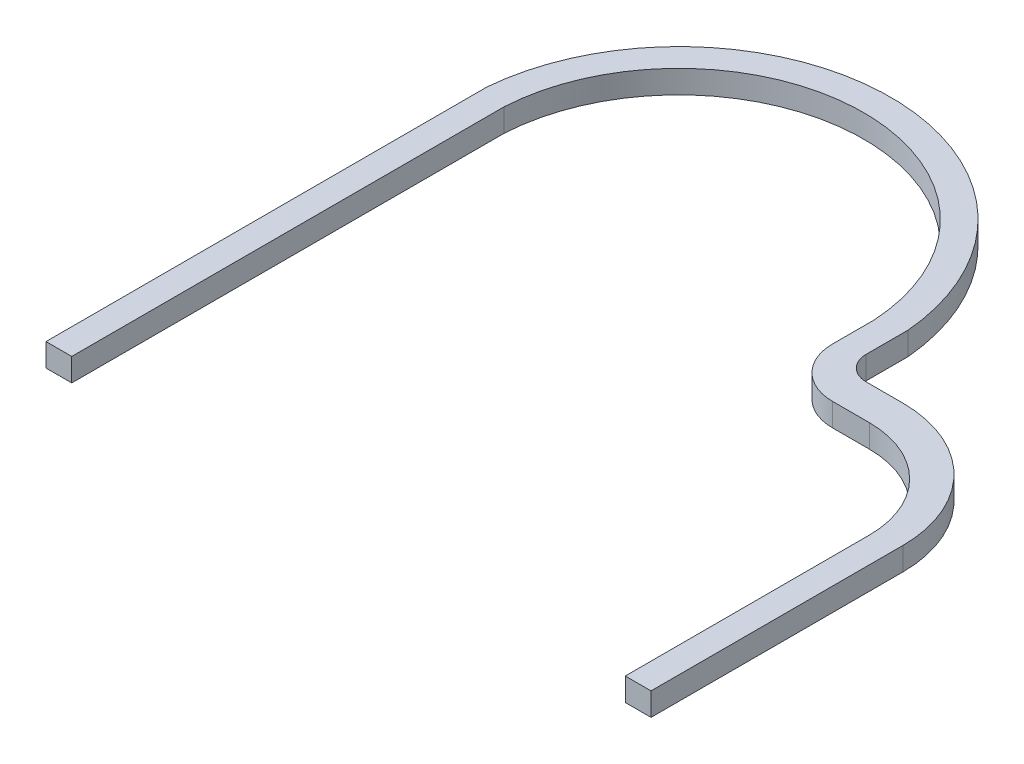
ISO-10303-21;
HEADER;
FILE_DESCRIPTION(('STEP AP214'),'2;1');
FILE_NAME('part.step','',(''),(''),'','','');
FILE_SCHEMA(('AUTOMOTIVE_DESIGN { 1 0 10303 214 1 1 1 1 }'));
ENDSEC;
DATA;
#1=APPLICATION_CONTEXT('core data for automotive mechanical design processes');
#2=APPLICATION_PROTOCOL_DEFINITION('international standard','automotive_design',2000,#1);
#3=PRODUCT_CONTEXT('',#1,'mechanical');
#4=PRODUCT('Part','Part','',(#3));
#5=PRODUCT_RELATED_PRODUCT_CATEGORY('part','',(#4));
#6=PRODUCT_DEFINITION_FORMATION('','',#4);
#7=PRODUCT_DEFINITION_CONTEXT('part definition',#1,'design');
#8=PRODUCT_DEFINITION('design','',#6,#7);
#9=PRODUCT_DEFINITION_SHAPE('','',#8);
#10=(LENGTH_UNIT() NAMED_UNIT(*) SI_UNIT(.MILLI.,.METRE.));
#11=(NAMED_UNIT(*) PLANE_ANGLE_UNIT() SI_UNIT($,.RADIAN.));
#12=(NAMED_UNIT(*) SI_UNIT($,.STERADIAN.) SOLID_ANGLE_UNIT());
#13=UNCERTAINTY_MEASURE_WITH_UNIT(LENGTH_MEASURE(1.E-05),#10,'distance_accuracy_value','');
#14=(GEOMETRIC_REPRESENTATION_CONTEXT(3) GLOBAL_UNCERTAINTY_ASSIGNED_CONTEXT((#13)) GLOBAL_UNIT_ASSIGNED_CONTEXT((#10,
#11,#12)) REPRESENTATION_CONTEXT('',''));
#15=CARTESIAN_POINT('',(0.,0.,0.));
#16=DIRECTION('',(0.,0.,1.));
#17=DIRECTION('',(1.,0.,0.));
#18=AXIS2_PLACEMENT_3D('',#15,#16,#17);
#19=CARTESIAN_POINT('',(-10.16,3.175,11.2564952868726));
#20=DIRECTION('',(0.,-1.,0.));
#21=DIRECTION('',(0.,0.,-1.));
#22=AXIS2_PLACEMENT_3D('',#19,#20,#21);
#23=CYLINDRICAL_SURFACE('',#22,13.462);
#24=CARTESIAN_POINT('',(-10.16,0.,11.2564952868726));
#25=DIRECTION('',(0.,1.,0.));
#26=DIRECTION('',(0.,0.,1.));
#27=AXIS2_PLACEMENT_3D('',#24,#25,#26);
#28=CIRCLE('',#27,13.462);
#29=CARTESIAN_POINT('',(3.30200000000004,0.,11.2564952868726));
#30=VERTEX_POINT('',#29);
#31=CARTESIAN_POINT('',(-10.16,0.,-2.20550471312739));
#32=VERTEX_POINT('',#31);
#33=EDGE_CURVE('E176',#30,#32,#28,.T.);
#34=ORIENTED_EDGE('',*,*,#33,.F.);
#35=DIRECTION('',(0.,-1.,0.));
#36=VECTOR('',#35,1.);
#37=CARTESIAN_POINT('',(3.30200000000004,3.175,11.2564952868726));
#38=LINE('',#37,#36);
#39=CARTESIAN_POINT('',(3.30200000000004,3.175,11.2564952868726));
#40=VERTEX_POINT('',#39);
#41=EDGE_CURVE('E11',#40,#30,#38,.T.);
#42=ORIENTED_EDGE('',*,*,#41,.F.);
#43=CARTESIAN_POINT('',(-10.16,3.175,11.2564952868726));
#44=DIRECTION('',(0.,1.,0.));
#45=DIRECTION('',(0.,0.,1.));
#46=AXIS2_PLACEMENT_3D('',#43,#44,#45);
#47=CIRCLE('',#46,13.462);
#48=CARTESIAN_POINT('',(-10.16,3.175,-2.20550471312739));
#49=VERTEX_POINT('',#48);
#50=EDGE_CURVE('E216',#40,#49,#47,.T.);
#51=ORIENTED_EDGE('',*,*,#50,.T.);
#52=DIRECTION('',(0.,-1.,0.));
#53=VECTOR('',#52,1.);
#54=CARTESIAN_POINT('',(-10.16,3.175,-2.20550471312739));
#55=LINE('',#54,#53);
#56=EDGE_CURVE('E51',#49,#32,#55,.T.);
#57=ORIENTED_EDGE('',*,*,#56,.T.);
#58=EDGE_LOOP('',(#34,#42,#51,#57));
#59=FACE_BOUND('',#58,.T.);
#60=ADVANCED_FACE('F35',(#59),#23,.F.);
#61=CARTESIAN_POINT('',(3.30200000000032,3.175,0.));
#62=DIRECTION('',(1.,0.,0.));
#63=DIRECTION('',(0.,0.,-1.));
#64=AXIS2_PLACEMENT_3D('',#61,#62,#63);
#65=PLANE('',#64);
#66=DIRECTION('',(0.,0.,1.));
#67=VECTOR('',#66,1.);
#68=CARTESIAN_POINT('',(3.30200000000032,0.,0.));
#69=LINE('',#68,#67);
#70=CARTESIAN_POINT('',(3.30199999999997,0.,44.958));
#71=VERTEX_POINT('',#70);
#72=EDGE_CURVE('E178',#30,#71,#69,.T.);
#73=ORIENTED_EDGE('',*,*,#72,.T.);
#74=DIRECTION('',(0.,-1.,0.));
#75=VECTOR('',#74,1.);
#76=CARTESIAN_POINT('',(3.30199999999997,3.175,44.958));
#77=LINE('',#76,#75);
#78=CARTESIAN_POINT('',(3.30199999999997,3.175,44.958));
#79=VERTEX_POINT('',#78);
#80=EDGE_CURVE('E43',#79,#71,#77,.T.);
#81=ORIENTED_EDGE('',*,*,#80,.F.);
#82=DIRECTION('',(0.,0.,1.));
#83=VECTOR('',#82,1.);
#84=CARTESIAN_POINT('',(3.30200000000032,3.175,0.));
#85=LINE('',#84,#83);
#86=EDGE_CURVE('E532',#40,#79,#85,.T.);
#87=ORIENTED_EDGE('',*,*,#86,.F.);
#88=ORIENTED_EDGE('',*,*,#41,.T.);
#89=EDGE_LOOP('',(#73,#81,#87,#88));
#90=FACE_BOUND('',#89,.T.);
#91=ADVANCED_FACE('F252',(#90),#65,.F.);
#92=CARTESIAN_POINT('',(0.,3.175,44.958));
#93=DIRECTION('',(0.,0.,1.));
#94=DIRECTION('',(1.,0.,0.));
#95=AXIS2_PLACEMENT_3D('',#92,#93,#94);
#96=PLANE('',#95);
#97=DIRECTION('',(-1.,0.,0.));
#98=VECTOR('',#97,1.);
#99=CARTESIAN_POINT('',(0.,0.,44.958));
#100=LINE('',#99,#98);
#101=CARTESIAN_POINT('',(6.858,0.,44.958));
#102=VERTEX_POINT('',#101);
#103=EDGE_CURVE('E181',#102,#71,#100,.T.);
#104=ORIENTED_EDGE('',*,*,#103,.F.);
#105=DIRECTION('',(0.,-1.,0.));
#106=VECTOR('',#105,1.);
#107=CARTESIAN_POINT('',(6.858,3.175,44.958));
#108=LINE('',#107,#106);
#109=CARTESIAN_POINT('',(6.858,3.175,44.958));
#110=VERTEX_POINT('',#109);
#111=EDGE_CURVE('E242',#110,#102,#108,.T.);
#112=ORIENTED_EDGE('',*,*,#111,.F.);
#113=DIRECTION('',(-1.,0.,0.));
#114=VECTOR('',#113,1.);
#115=CARTESIAN_POINT('',(0.,3.175,44.958));
#116=LINE('',#115,#114);
#117=EDGE_CURVE('E249',#110,#79,#116,.T.);
#118=ORIENTED_EDGE('',*,*,#117,.T.);
#119=ORIENTED_EDGE('',*,*,#80,.T.);
#120=EDGE_LOOP('',(#104,#112,#118,#119));
#121=FACE_BOUND('',#120,.T.);
#122=ADVANCED_FACE('F247',(#121),#96,.T.);
#123=CARTESIAN_POINT('',(6.858,3.175,0.));
#124=DIRECTION('',(-1.,0.,0.));
#125=DIRECTION('',(0.,0.,1.));
#126=AXIS2_PLACEMENT_3D('',#123,#124,#125);
#127=PLANE('',#126);
#128=DIRECTION('',(0.,0.,-1.));
#129=VECTOR('',#128,1.);
#130=CARTESIAN_POINT('',(6.858,0.,0.));
#131=LINE('',#130,#129);
#132=CARTESIAN_POINT('',(6.858,0.,10.16));
#133=VERTEX_POINT('',#132);
#134=EDGE_CURVE('E184',#102,#133,#131,.T.);
#135=ORIENTED_EDGE('',*,*,#134,.T.);
#136=DIRECTION('',(0.,-1.,0.));
#137=VECTOR('',#136,1.);
#138=CARTESIAN_POINT('',(6.858,3.175,10.16));
#139=LINE('',#138,#137);
#140=CARTESIAN_POINT('',(6.858,3.175,10.16));
#141=VERTEX_POINT('',#140);
#142=EDGE_CURVE('E239',#141,#133,#139,.T.);
#143=ORIENTED_EDGE('',*,*,#142,.F.);
#144=DIRECTION('',(0.,0.,-1.));
#145=VECTOR('',#144,1.);
#146=CARTESIAN_POINT('',(6.858,3.175,0.));
#147=LINE('',#146,#145);
#148=EDGE_CURVE('E269',#110,#141,#147,.T.);
#149=ORIENTED_EDGE('',*,*,#148,.F.);
#150=ORIENTED_EDGE('',*,*,#111,.T.);
#151=EDGE_LOOP('',(#135,#143,#149,#150));
#152=FACE_BOUND('',#151,.T.);
#153=ADVANCED_FACE('F260',(#152),#127,.F.);
#154=CARTESIAN_POINT('',(-10.16,3.175,10.16));
#155=DIRECTION('',(0.,-1.,0.));
#156=DIRECTION('',(0.,0.,-1.));
#157=AXIS2_PLACEMENT_3D('',#154,#155,#156);
#158=CYLINDRICAL_SURFACE('',#157,17.018);
#159=CARTESIAN_POINT('',(-10.16,0.,10.16));
#160=DIRECTION('',(0.,1.,0.));
#161=DIRECTION('',(0.,0.,1.));
#162=AXIS2_PLACEMENT_3D('',#159,#160,#161);
#163=CIRCLE('',#162,17.018);
#164=CARTESIAN_POINT('',(-10.16,0.,-6.858));
#165=VERTEX_POINT('',#164);
#166=EDGE_CURVE('E186',#133,#165,#163,.T.);
#167=ORIENTED_EDGE('',*,*,#166,.T.);
#168=DIRECTION('',(0.,-1.,0.));
#169=VECTOR('',#168,1.);
#170=CARTESIAN_POINT('',(-10.16,3.175,-6.858));
#171=LINE('',#170,#169);
#172=CARTESIAN_POINT('',(-10.16,3.175,-6.858));
#173=VERTEX_POINT('',#172);
#174=EDGE_CURVE('E236',#173,#165,#171,.T.);
#175=ORIENTED_EDGE('',*,*,#174,.F.);
#176=CARTESIAN_POINT('',(-10.16,3.175,10.16));
#177=DIRECTION('',(0.,1.,0.));
#178=DIRECTION('',(0.,0.,1.));
#179=AXIS2_PLACEMENT_3D('',#176,#177,#178);
#180=CIRCLE('',#179,17.018);
#181=EDGE_CURVE('E266',#141,#173,#180,.T.);
#182=ORIENTED_EDGE('',*,*,#181,.F.);
#183=ORIENTED_EDGE('',*,*,#142,.T.);
#184=EDGE_LOOP('',(#167,#175,#182,#183));
#185=FACE_BOUND('',#184,.T.);
#186=ADVANCED_FACE('F264',(#185),#158,.T.);
#187=CARTESIAN_POINT('',(0.,3.175,-6.858));
#188=DIRECTION('',(0.,0.,1.));
#189=DIRECTION('',(1.,0.,0.));
#190=AXIS2_PLACEMENT_3D('',#187,#188,#189);
#191=PLANE('',#190);
#192=DIRECTION('',(-1.,0.,0.));
#193=VECTOR('',#192,1.);
#194=CARTESIAN_POINT('',(0.,0.,-6.858));
#195=LINE('',#194,#193);
#196=CARTESIAN_POINT('',(-15.24,0.,-6.858));
#197=VERTEX_POINT('',#196);
#198=EDGE_CURVE('E188',#165,#197,#195,.T.);
#199=ORIENTED_EDGE('',*,*,#198,.T.);
#200=DIRECTION('',(0.,-1.,0.));
#201=VECTOR('',#200,1.);
#202=CARTESIAN_POINT('',(-15.24,3.175,-6.858));
#203=LINE('',#202,#201);
#204=CARTESIAN_POINT('',(-15.24,3.175,-6.858));
#205=VERTEX_POINT('',#204);
#206=EDGE_CURVE('E233',#205,#197,#203,.T.);
#207=ORIENTED_EDGE('',*,*,#206,.F.);
#208=DIRECTION('',(-1.,0.,0.));
#209=VECTOR('',#208,1.);
#210=CARTESIAN_POINT('',(0.,3.175,-6.858));
#211=LINE('',#210,#209);
#212=EDGE_CURVE('E268',#173,#205,#211,.T.);
#213=ORIENTED_EDGE('',*,*,#212,.F.);
#214=ORIENTED_EDGE('',*,*,#174,.T.);
#215=EDGE_LOOP('',(#199,#207,#213,#214));
#216=FACE_BOUND('',#215,.T.);
#217=ADVANCED_FACE('F316',(#216),#191,.F.);
#218=CARTESIAN_POINT('',(-15.24,3.175,-10.16));
#219=DIRECTION('',(0.,-1.,0.));
#220=DIRECTION('',(0.,0.,-1.));
#221=AXIS2_PLACEMENT_3D('',#218,#219,#220);
#222=CYLINDRICAL_SURFACE('',#221,3.302);
#223=CARTESIAN_POINT('',(-15.24,0.,-10.16));
#224=DIRECTION('',(0.,1.,0.));
#225=DIRECTION('',(0.,0.,1.));
#226=AXIS2_PLACEMENT_3D('',#223,#224,#225);
#227=CIRCLE('',#226,3.302);
#228=CARTESIAN_POINT('',(-18.542,0.,-10.16));
#229=VERTEX_POINT('',#228);
#230=EDGE_CURVE('E190',#197,#229,#227,.F.);
#231=ORIENTED_EDGE('',*,*,#230,.T.);
#232=DIRECTION('',(0.,-1.,0.));
#233=VECTOR('',#232,1.);
#234=CARTESIAN_POINT('',(-18.542,3.175,-10.16));
#235=LINE('',#234,#233);
#236=CARTESIAN_POINT('',(-18.542,3.175,-10.16));
#237=VERTEX_POINT('',#236);
#238=EDGE_CURVE('E231',#237,#229,#235,.T.);
#239=ORIENTED_EDGE('',*,*,#238,.F.);
#240=CARTESIAN_POINT('',(-15.24,3.175,-10.16));
#241=DIRECTION('',(0.,1.,0.));
#242=DIRECTION('',(0.,0.,1.));
#243=AXIS2_PLACEMENT_3D('',#240,#241,#242);
#244=CIRCLE('',#243,3.302);
#245=EDGE_CURVE('E271',#205,#237,#244,.F.);
#246=ORIENTED_EDGE('',*,*,#245,.F.);
#247=ORIENTED_EDGE('',*,*,#206,.T.);
#248=EDGE_LOOP('',(#231,#239,#246,#247));
#249=FACE_BOUND('',#248,.T.);
#250=ADVANCED_FACE('F319',(#249),#222,.F.);
#251=CARTESIAN_POINT('',(-18.5420000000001,3.175,-2.66482218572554E-13));
#252=DIRECTION('',(1.,0.,0.));
#253=DIRECTION('',(0.,0.,-1.));
#254=AXIS2_PLACEMENT_3D('',#251,#252,#253);
#255=PLANE('',#254);
#256=DIRECTION('',(0.,0.,1.));
#257=VECTOR('',#256,1.);
#258=CARTESIAN_POINT('',(-18.5420000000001,0.,-2.66482218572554E-13));
#259=LINE('',#258,#257);
#260=CARTESIAN_POINT('',(-18.5419999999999,0.,-15.9537511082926));
#261=VERTEX_POINT('',#260);
#262=EDGE_CURVE('E193',#261,#229,#259,.T.);
#263=ORIENTED_EDGE('',*,*,#262,.F.);
#264=DIRECTION('',(0.,-1.,0.));
#265=VECTOR('',#264,1.);
#266=CARTESIAN_POINT('',(-18.5419999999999,3.175,-15.9537511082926));
#267=LINE('',#266,#265);
#268=CARTESIAN_POINT('',(-18.5419999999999,3.175,-15.9537511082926));
#269=VERTEX_POINT('',#268);
#270=EDGE_CURVE('E229',#269,#261,#267,.T.);
#271=ORIENTED_EDGE('',*,*,#270,.F.);
#272=DIRECTION('',(0.,0.,1.));
#273=VECTOR('',#272,1.);
#274=CARTESIAN_POINT('',(-18.5420000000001,3.175,-2.66482218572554E-13));
#275=LINE('',#274,#273);
#276=EDGE_CURVE('E277',#269,#237,#275,.T.);
#277=ORIENTED_EDGE('',*,*,#276,.T.);
#278=ORIENTED_EDGE('',*,*,#238,.T.);
#279=EDGE_LOOP('',(#263,#271,#277,#278));
#280=FACE_BOUND('',#279,.T.);
#281=ADVANCED_FACE('F323',(#280),#255,.T.);
#282=CARTESIAN_POINT('',(-47.625,3.175,-13.4125578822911));
#283=DIRECTION('',(0.,-1.,0.));
#284=DIRECTION('',(0.,0.,-1.));
#285=AXIS2_PLACEMENT_3D('',#282,#283,#284);
#286=CYLINDRICAL_SURFACE('',#285,29.1938101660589);
#287=CARTESIAN_POINT('',(-47.625,0.,-13.4125578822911));
#288=DIRECTION('',(0.,1.,0.));
#289=DIRECTION('',(0.,0.,1.));
#290=AXIS2_PLACEMENT_3D('',#287,#288,#289);
#291=CIRCLE('',#290,29.1938101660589);
#292=CARTESIAN_POINT('',(-76.708,0.,-15.9537511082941));
#293=VERTEX_POINT('',#292);
#294=EDGE_CURVE('E196',#261,#293,#291,.T.);
#295=ORIENTED_EDGE('',*,*,#294,.T.);
#296=DIRECTION('',(0.,-1.,0.));
#297=VECTOR('',#296,1.);
#298=CARTESIAN_POINT('',(-76.708,3.175,-15.9537511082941));
#299=LINE('',#298,#297);
#300=CARTESIAN_POINT('',(-76.708,3.175,-15.9537511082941));
#301=VERTEX_POINT('',#300);
#302=EDGE_CURVE('E227',#301,#293,#299,.T.);
#303=ORIENTED_EDGE('',*,*,#302,.F.);
#304=CARTESIAN_POINT('',(-47.625,3.175,-13.4125578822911));
#305=DIRECTION('',(0.,1.,0.));
#306=DIRECTION('',(0.,0.,1.));
#307=AXIS2_PLACEMENT_3D('',#304,#305,#306);
#308=CIRCLE('',#307,29.1938101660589);
#309=EDGE_CURVE('E280',#269,#301,#308,.T.);
#310=ORIENTED_EDGE('',*,*,#309,.F.);
#311=ORIENTED_EDGE('',*,*,#270,.T.);
#312=EDGE_LOOP('',(#295,#303,#310,#311));
#313=FACE_BOUND('',#312,.T.);
#314=ADVANCED_FACE('F327',(#313),#286,.T.);
#315=CARTESIAN_POINT('',(-76.708,3.175,0.));
#316=DIRECTION('',(-1.,0.,0.));
#317=DIRECTION('',(0.,0.,1.));
#318=AXIS2_PLACEMENT_3D('',#315,#316,#317);
#319=PLANE('',#318);
#320=DIRECTION('',(0.,0.,-1.));
#321=VECTOR('',#320,1.);
#322=CARTESIAN_POINT('',(-76.708,0.,0.));
#323=LINE('',#322,#321);
#324=CARTESIAN_POINT('',(-76.708,0.,44.958));
#325=VERTEX_POINT('',#324);
#326=EDGE_CURVE('E199',#325,#293,#323,.T.);
#327=ORIENTED_EDGE('',*,*,#326,.F.);
#328=DIRECTION('',(0.,-1.,0.));
#329=VECTOR('',#328,1.);
#330=CARTESIAN_POINT('',(-76.708,3.175,44.958));
#331=LINE('',#330,#329);
#332=CARTESIAN_POINT('',(-76.708,3.175,44.958));
#333=VERTEX_POINT('',#332);
#334=EDGE_CURVE('E225',#333,#325,#331,.T.);
#335=ORIENTED_EDGE('',*,*,#334,.F.);
#336=DIRECTION('',(0.,0.,-1.));
#337=VECTOR('',#336,1.);
#338=CARTESIAN_POINT('',(-76.708,3.175,0.));
#339=LINE('',#338,#337);
#340=EDGE_CURVE('E282',#333,#301,#339,.T.);
#341=ORIENTED_EDGE('',*,*,#340,.T.);
#342=ORIENTED_EDGE('',*,*,#302,.T.);
#343=EDGE_LOOP('',(#327,#335,#341,#342));
#344=FACE_BOUND('',#343,.T.);
#345=ADVANCED_FACE('F331',(#344),#319,.T.);
#346=CARTESIAN_POINT('',(0.,3.175,44.958));
#347=DIRECTION('',(0.,0.,-1.));
#348=DIRECTION('',(-1.,0.,0.));
#349=AXIS2_PLACEMENT_3D('',#346,#347,#348);
#350=PLANE('',#349);
#351=DIRECTION('',(1.,0.,0.));
#352=VECTOR('',#351,1.);
#353=CARTESIAN_POINT('',(0.,0.,44.958));
#354=LINE('',#353,#352);
#355=CARTESIAN_POINT('',(-73.152,0.,44.958));
#356=VERTEX_POINT('',#355);
#357=EDGE_CURVE('E202',#325,#356,#354,.T.);
#358=ORIENTED_EDGE('',*,*,#357,.T.);
#359=DIRECTION('',(0.,-1.,0.));
#360=VECTOR('',#359,1.);
#361=CARTESIAN_POINT('',(-73.152,3.175,44.958));
#362=LINE('',#361,#360);
#363=CARTESIAN_POINT('',(-73.152,3.175,44.958));
#364=VERTEX_POINT('',#363);
#365=EDGE_CURVE('E222',#364,#356,#362,.T.);
#366=ORIENTED_EDGE('',*,*,#365,.F.);
#367=DIRECTION('',(1.,0.,0.));
#368=VECTOR('',#367,1.);
#369=CARTESIAN_POINT('',(0.,3.175,44.958));
#370=LINE('',#369,#368);
#371=EDGE_CURVE('E285',#333,#364,#370,.T.);
#372=ORIENTED_EDGE('',*,*,#371,.F.);
#373=ORIENTED_EDGE('',*,*,#334,.T.);
#374=EDGE_LOOP('',(#358,#366,#372,#373));
#375=FACE_BOUND('',#374,.T.);
#376=ADVANCED_FACE('F335',(#375),#350,.F.);
#377=CARTESIAN_POINT('',(-73.152,3.175,0.));
#378=DIRECTION('',(-1.,0.,0.));
#379=DIRECTION('',(0.,0.,1.));
#380=AXIS2_PLACEMENT_3D('',#377,#378,#379);
#381=PLANE('',#380);
#382=DIRECTION('',(0.,0.,-1.));
#383=VECTOR('',#382,1.);
#384=CARTESIAN_POINT('',(-73.152,0.,0.));
#385=LINE('',#384,#383);
#386=CARTESIAN_POINT('',(-73.152,0.,-14.7785047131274));
#387=VERTEX_POINT('',#386);
#388=EDGE_CURVE('E204',#356,#387,#385,.T.);
#389=ORIENTED_EDGE('',*,*,#388,.T.);
#390=DIRECTION('',(0.,-1.,0.));
#391=VECTOR('',#390,1.);
#392=CARTESIAN_POINT('',(-73.152,3.175,-14.7785047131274));
#393=LINE('',#392,#391);
#394=CARTESIAN_POINT('',(-73.152,3.175,-14.7785047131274));
#395=VERTEX_POINT('',#394);
#396=EDGE_CURVE('E220',#395,#387,#393,.T.);
#397=ORIENTED_EDGE('',*,*,#396,.F.);
#398=DIRECTION('',(0.,0.,-1.));
#399=VECTOR('',#398,1.);
#400=CARTESIAN_POINT('',(-73.152,3.175,0.));
#401=LINE('',#400,#399);
#402=EDGE_CURVE('E287',#364,#395,#401,.T.);
#403=ORIENTED_EDGE('',*,*,#402,.F.);
#404=ORIENTED_EDGE('',*,*,#365,.T.);
#405=EDGE_LOOP('',(#389,#397,#403,#404));
#406=FACE_BOUND('',#405,.T.);
#407=ADVANCED_FACE('F339',(#406),#381,.F.);
#408=CARTESIAN_POINT('',(-47.625,3.175,-13.335));
#409=DIRECTION('',(0.,-1.,0.));
#410=DIRECTION('',(0.,0.,-1.));
#411=AXIS2_PLACEMENT_3D('',#408,#409,#410);
#412=CYLINDRICAL_SURFACE('',#411,25.5677811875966);
#413=CARTESIAN_POINT('',(-47.625,0.,-13.335));
#414=DIRECTION('',(0.,1.,0.));
#415=DIRECTION('',(0.,0.,1.));
#416=AXIS2_PLACEMENT_3D('',#413,#414,#415);
#417=CIRCLE('',#416,25.5677811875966);
#418=CARTESIAN_POINT('',(-22.098,0.,-14.7785047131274));
#419=VERTEX_POINT('',#418);
#420=EDGE_CURVE('E207',#419,#387,#417,.T.);
#421=ORIENTED_EDGE('',*,*,#420,.F.);
#422=DIRECTION('',(0.,-1.,0.));
#423=VECTOR('',#422,1.);
#424=CARTESIAN_POINT('',(-22.098,3.175,-14.7785047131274));
#425=LINE('',#424,#423);
#426=CARTESIAN_POINT('',(-22.098,3.175,-14.7785047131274));
#427=VERTEX_POINT('',#426);
#428=EDGE_CURVE('E168',#427,#419,#425,.T.);
#429=ORIENTED_EDGE('',*,*,#428,.F.);
#430=CARTESIAN_POINT('',(-47.625,3.175,-13.335));
#431=DIRECTION('',(0.,1.,0.));
#432=DIRECTION('',(0.,0.,1.));
#433=AXIS2_PLACEMENT_3D('',#430,#431,#432);
#434=CIRCLE('',#433,25.5677811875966);
#435=EDGE_CURVE('E158',#427,#395,#434,.T.);
#436=ORIENTED_EDGE('',*,*,#435,.T.);
#437=ORIENTED_EDGE('',*,*,#396,.T.);
#438=EDGE_LOOP('',(#421,#429,#436,#437));
#439=FACE_BOUND('',#438,.T.);
#440=ADVANCED_FACE('F290',(#439),#412,.F.);
#441=CARTESIAN_POINT('',(-22.098,3.175,0.));
#442=DIRECTION('',(1.,0.,0.));
#443=DIRECTION('',(0.,0.,-1.));
#444=AXIS2_PLACEMENT_3D('',#441,#442,#443);
#445=PLANE('',#444);
#446=DIRECTION('',(0.,0.,1.));
#447=VECTOR('',#446,1.);
#448=CARTESIAN_POINT('',(-22.098,0.,0.));
#449=LINE('',#448,#447);
#450=CARTESIAN_POINT('',(-22.098,0.,-9.06350471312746));
#451=VERTEX_POINT('',#450);
#452=EDGE_CURVE('E165',#419,#451,#449,.T.);
#453=ORIENTED_EDGE('',*,*,#452,.T.);
#454=DIRECTION('',(0.,-1.,0.));
#455=VECTOR('',#454,1.);
#456=CARTESIAN_POINT('',(-22.098,3.175,-9.06350471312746));
#457=LINE('',#456,#455);
#458=CARTESIAN_POINT('',(-22.098,3.175,-9.06350471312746));
#459=VERTEX_POINT('',#458);
#460=EDGE_CURVE('E162',#459,#451,#457,.T.);
#461=ORIENTED_EDGE('',*,*,#460,.F.);
#462=DIRECTION('',(0.,0.,1.));
#463=VECTOR('',#462,1.);
#464=CARTESIAN_POINT('',(-22.098,3.175,0.));
#465=LINE('',#464,#463);
#466=EDGE_CURVE('E150',#427,#459,#465,.T.);
#467=ORIENTED_EDGE('',*,*,#466,.F.);
#468=ORIENTED_EDGE('',*,*,#428,.T.);
#469=EDGE_LOOP('',(#453,#461,#467,#468));
#470=FACE_BOUND('',#469,.T.);
#471=ADVANCED_FACE('F163',(#470),#445,.F.);
#472=CARTESIAN_POINT('',(-15.24,3.175,-9.06350471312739));
#473=DIRECTION('',(0.,-1.,0.));
#474=DIRECTION('',(0.,0.,-1.));
#475=AXIS2_PLACEMENT_3D('',#472,#473,#474);
#476=CYLINDRICAL_SURFACE('',#475,6.858);
#477=CARTESIAN_POINT('',(-15.24,0.,-9.06350471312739));
#478=DIRECTION('',(0.,1.,0.));
#479=DIRECTION('',(0.,0.,1.));
#480=AXIS2_PLACEMENT_3D('',#477,#478,#479);
#481=CIRCLE('',#480,6.858);
#482=CARTESIAN_POINT('',(-15.2399999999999,0.,-2.20550471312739));
#483=VERTEX_POINT('',#482);
#484=EDGE_CURVE('E211',#483,#451,#481,.F.);
#485=ORIENTED_EDGE('',*,*,#484,.F.);
#486=DIRECTION('',(0.,-1.,0.));
#487=VECTOR('',#486,1.);
#488=CARTESIAN_POINT('',(-15.2399999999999,3.175,-2.20550471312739));
#489=LINE('',#488,#487);
#490=CARTESIAN_POINT('',(-15.2399999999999,3.175,-2.20550471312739));
#491=VERTEX_POINT('',#490);
#492=EDGE_CURVE('E100',#491,#483,#489,.T.);
#493=ORIENTED_EDGE('',*,*,#492,.F.);
#494=CARTESIAN_POINT('',(-15.24,3.175,-9.06350471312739));
#495=DIRECTION('',(0.,1.,0.));
#496=DIRECTION('',(0.,0.,1.));
#497=AXIS2_PLACEMENT_3D('',#494,#495,#496);
#498=CIRCLE('',#497,6.858);
#499=EDGE_CURVE('E156',#491,#459,#498,.F.);
#500=ORIENTED_EDGE('',*,*,#499,.T.);
#501=ORIENTED_EDGE('',*,*,#460,.T.);
#502=EDGE_LOOP('',(#485,#493,#500,#501));
#503=FACE_BOUND('',#502,.T.);
#504=ADVANCED_FACE('F170',(#503),#476,.T.);
#505=CARTESIAN_POINT('',(0.,3.175,-2.20550471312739));
#506=DIRECTION('',(0.,0.,1.));
#507=DIRECTION('',(1.,0.,0.));
#508=AXIS2_PLACEMENT_3D('',#505,#506,#507);
#509=PLANE('',#508);
#510=DIRECTION('',(-1.,0.,0.));
#511=VECTOR('',#510,1.);
#512=CARTESIAN_POINT('',(0.,0.,-2.20550471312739));
#513=LINE('',#512,#511);
#514=EDGE_CURVE('E213',#32,#483,#513,.T.);
#515=ORIENTED_EDGE('',*,*,#514,.F.);
#516=ORIENTED_EDGE('',*,*,#56,.F.);
#517=DIRECTION('',(-1.,0.,0.));
#518=VECTOR('',#517,1.);
#519=CARTESIAN_POINT('',(0.,3.175,-2.20550471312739));
#520=LINE('',#519,#518);
#521=EDGE_CURVE('E171',#49,#491,#520,.T.);
#522=ORIENTED_EDGE('',*,*,#521,.T.);
#523=ORIENTED_EDGE('',*,*,#492,.T.);
#524=EDGE_LOOP('',(#515,#516,#522,#523));
#525=FACE_BOUND('',#524,.T.);
#526=ADVANCED_FACE('F293',(#525),#509,.T.);
#527=CARTESIAN_POINT('',(0.,3.175,0.));
#528=DIRECTION('',(0.,1.,0.));
#529=DIRECTION('',(0.,0.,1.));
#530=AXIS2_PLACEMENT_3D('',#527,#528,#529);
#531=PLANE('',#530);
#532=ORIENTED_EDGE('',*,*,#50,.F.);
#533=ORIENTED_EDGE('',*,*,#86,.T.);
#534=ORIENTED_EDGE('',*,*,#117,.F.);
#535=ORIENTED_EDGE('',*,*,#148,.T.);
#536=ORIENTED_EDGE('',*,*,#181,.T.);
#537=ORIENTED_EDGE('',*,*,#212,.T.);
#538=ORIENTED_EDGE('',*,*,#245,.T.);
#539=ORIENTED_EDGE('',*,*,#276,.F.);
#540=ORIENTED_EDGE('',*,*,#309,.T.);
#541=ORIENTED_EDGE('',*,*,#340,.F.);
#542=ORIENTED_EDGE('',*,*,#371,.T.);
#543=ORIENTED_EDGE('',*,*,#402,.T.);
#544=ORIENTED_EDGE('',*,*,#435,.F.);
#545=ORIENTED_EDGE('',*,*,#466,.T.);
#546=ORIENTED_EDGE('',*,*,#499,.F.);
#547=ORIENTED_EDGE('',*,*,#521,.F.);
#548=EDGE_LOOP('',(#532,#533,#534,#535,#536,#537,#538,#539,#540,#541,#542,#543,#544,#545,#546,#547));
#549=FACE_BOUND('',#548,.T.);
#550=ADVANCED_FACE('F153',(#549),#531,.T.);
#551=CARTESIAN_POINT('',(0.,0.,0.));
#552=DIRECTION('',(0.,1.,0.));
#553=DIRECTION('',(0.,0.,1.));
#554=AXIS2_PLACEMENT_3D('',#551,#552,#553);
#555=PLANE('',#554);
#556=ORIENTED_EDGE('',*,*,#33,.T.);
#557=ORIENTED_EDGE('',*,*,#514,.T.);
#558=ORIENTED_EDGE('',*,*,#484,.T.);
#559=ORIENTED_EDGE('',*,*,#452,.F.);
#560=ORIENTED_EDGE('',*,*,#420,.T.);
#561=ORIENTED_EDGE('',*,*,#388,.F.);
#562=ORIENTED_EDGE('',*,*,#357,.F.);
#563=ORIENTED_EDGE('',*,*,#326,.T.);
#564=ORIENTED_EDGE('',*,*,#294,.F.);
#565=ORIENTED_EDGE('',*,*,#262,.T.);
#566=ORIENTED_EDGE('',*,*,#230,.F.);
#567=ORIENTED_EDGE('',*,*,#198,.F.);
#568=ORIENTED_EDGE('',*,*,#166,.F.);
#569=ORIENTED_EDGE('',*,*,#134,.F.);
#570=ORIENTED_EDGE('',*,*,#103,.T.);
#571=ORIENTED_EDGE('',*,*,#72,.F.);
#572=EDGE_LOOP('',(#556,#557,#558,#559,#560,#561,#562,#563,#564,#565,#566,#567,#568,#569,#570,#571));
#573=FACE_BOUND('',#572,.T.);
#574=ADVANCED_FACE('F255',(#573),#555,.F.);
#575=CLOSED_SHELL('',(#60,#91,#122,#153,#186,#217,#250,#281,#314,#345,#376,#407,#440,#471,#504,
#526,#550,#574));
#576=MANIFOLD_SOLID_BREP('B2',#575);
#577=ADVANCED_BREP_SHAPE_REPRESENTATION('',(#18,#576),#14);
#578=SHAPE_DEFINITION_REPRESENTATION(#9,#577);
ENDSEC;
END-ISO-10303-21;
